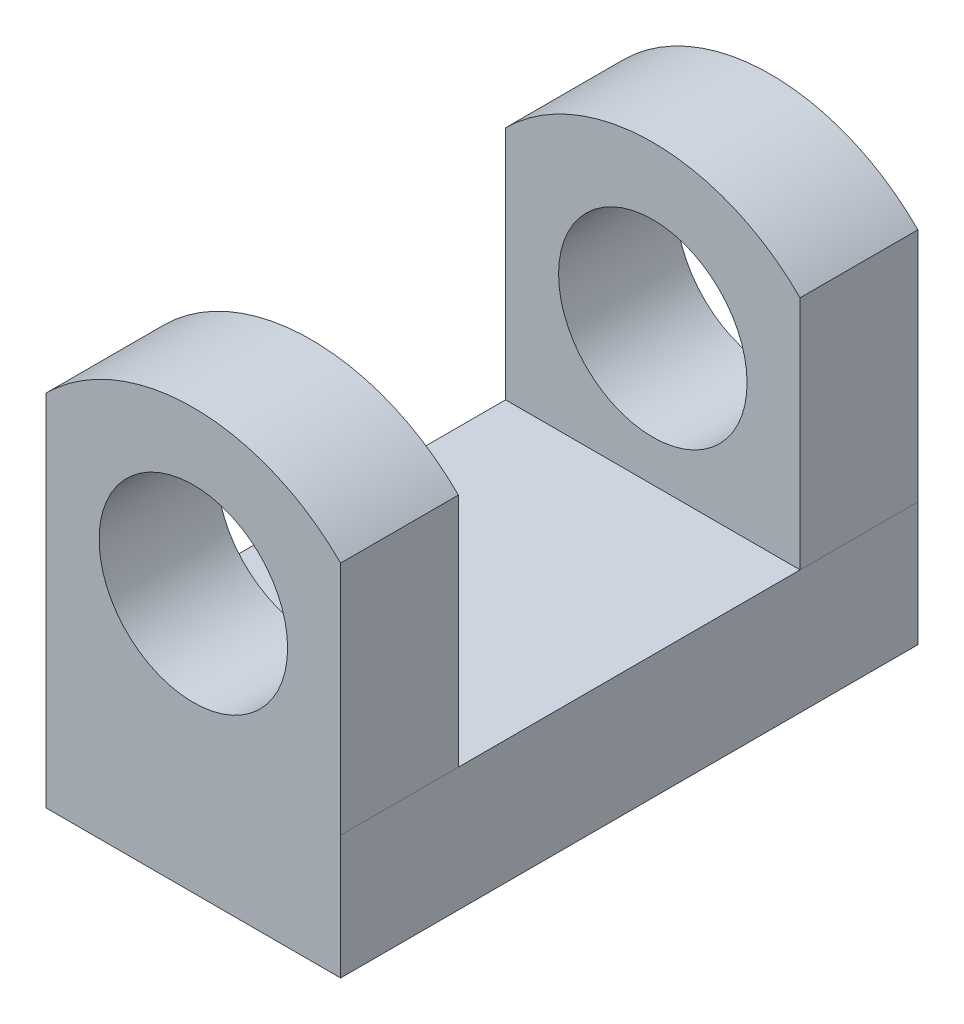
from build123d import *

# Parameters (mm, degrees)
BOSS_EXTRUDE1_DEPTH      = 0.254
BOSS_EXTRUDE1_DEPTH_BACK = 5.08
SKETCH2_W                = 12.7
SKETCH2_H                = 24.892
BOSS_EXTRUDE2_START      = -12.7
SKETCH4_W                = 5.08
SKETCH4_H                = 17.78
BOSS_EXTRUDE2_DEPTH      = 12.700012
BOSS_EXTRUDE3_DEPTH      = 6.350012
BOSS_EXTRUDE3_DEPTH_BACK = 6.35
SKETCH6_W                = 5.08
SKETCH6_H                = 17.78
SKETCH7_R                = 4.064
CUT_EXTRUDE1_DEPTH       = 32.387250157
CUT_EXTRUDE2_DEPTH       = 32.387250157


with BuildPart() as part:
    # Sketch2 → Boss-Extrude1 (new, two sides: drawn at the far end of the back side and taken through both)
    with BuildSketch(Plane(origin=(0, 0, 0), x_dir=(1, 0, 0), z_dir=(0, 1, 0)).offset(-BOSS_EXTRUDE1_DEPTH_BACK)):
        Rectangle(SKETCH2_W, SKETCH2_H)
    extrude(amount=BOSS_EXTRUDE1_DEPTH + BOSS_EXTRUDE1_DEPTH_BACK)

    # Sketch4 → Boss-Extrude2 (add)
    with BuildSketch(Plane(origin=(6.35, 0, 0), x_dir=(0, 0, -1), z_dir=(1, 0, 0)).offset(BOSS_EXTRUDE2_START)):
        with Locations((-9.906, 9.144)):
            Rectangle(SKETCH4_W, SKETCH4_H)
    extrude(amount=BOSS_EXTRUDE2_DEPTH)

    # Sketch6 → Boss-Extrude3 (add, two sides: drawn at the far end of the back side and taken through both)
    with BuildSketch(Plane(origin=(0, 0, 0), x_dir=(0, 0, -1), z_dir=(1, 0, 0)).offset(-BOSS_EXTRUDE3_DEPTH_BACK)):
        with Locations((9.906, 9.144)):
            Rectangle(SKETCH6_W, SKETCH6_H)
    extrude(amount=BOSS_EXTRUDE3_DEPTH + BOSS_EXTRUDE3_DEPTH_BACK)

    # Sketch7 → Cut-Extrude1 (cut, through all)
    with BuildSketch(Plane(origin=(0, 0, -12.446), x_dir=(-1, 0, 0), z_dir=(0, 0, -1))):
        with Locations((0, 6.096)):
            Circle(SKETCH7_R)
    extrude(amount=-CUT_EXTRUDE1_DEPTH, mode=Mode.SUBTRACT)

    # Sketch8 → Cut-Extrude2 (cut, through all)
    with BuildSketch(Plane(origin=(0, 0, -12.446), x_dir=(-1, 0, 0), z_dir=(0, 0, -1))):
        with BuildLine():
            Line((-6.350286, 10.414), (-6.350286, 18.034))
            Line((-6.350286, 18.034), (6.350025, 18.034))
            Line((6.350025, 18.034), (6.350025, 10.414))
            ThreePointArc((6.350025, 10.414), (-0.0001305, 13.044320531), (-6.350286, 10.414))
        make_face()
    extrude(amount=-CUT_EXTRUDE2_DEPTH, mode=Mode.SUBTRACT)


solid = part.part
